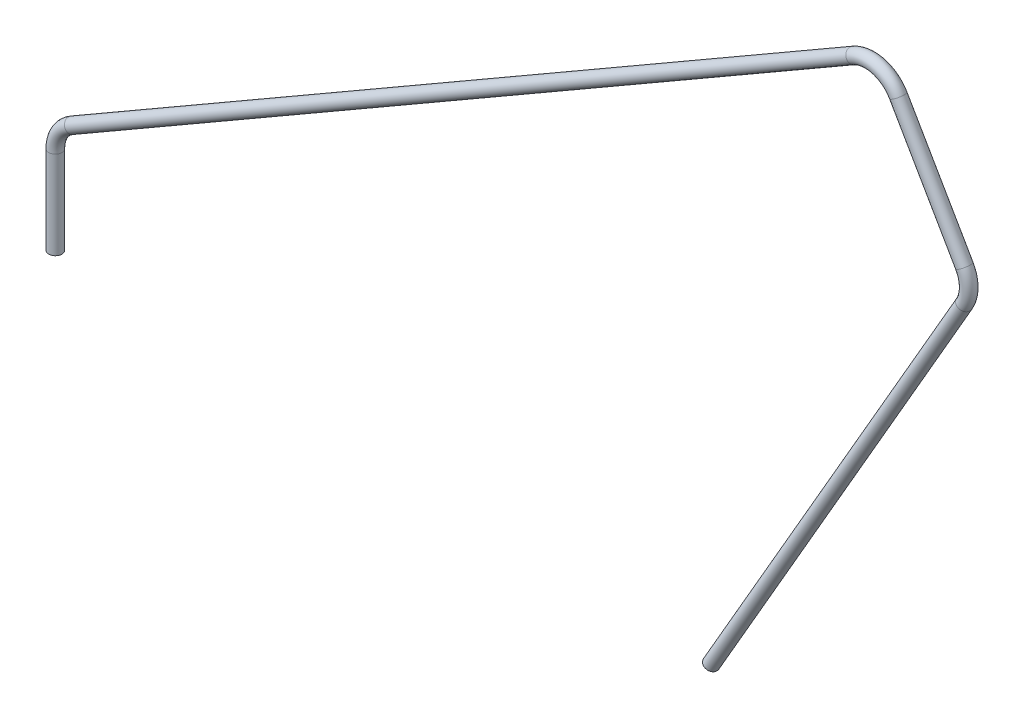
from build123d import *

# Parameters (mm, degrees)
ESQUISSE2_R = 3


with BuildPart() as part:
    # Balayage1: sweep along a path in Esquisse1
    with BuildLine(Plane.XY) as balayage1_path:
        Line((0, 0), (0, 40))
        ThreePointArc((0, 40), (2.009618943, 47.5), (7.5, 52.990381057))
        Line((7.5, 52.990381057), (362.570415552, 257.990381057))
        ThreePointArc((362.570415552, 257.990381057), (373.952701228, 259.488887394), (383.060796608, 252.5))
        Line((383.060796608, 252.5), (413.060796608, 200.538475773))
        ThreePointArc((413.060796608, 200.538475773), (415.070415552, 193.038475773), (413.060796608, 185.538475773))
        Line((413.060796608, 185.538475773), (298.060796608, -13.647367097))
    # Esquisse2 → Balayage1 (sweep)
    with BuildSketch(Plane(origin=(0, 0, 0), x_dir=(1, 0, 0), z_dir=(0, 1, 0))):
        Circle(ESQUISSE2_R)
    sweep(path=balayage1_path.line)


solid = part.part
